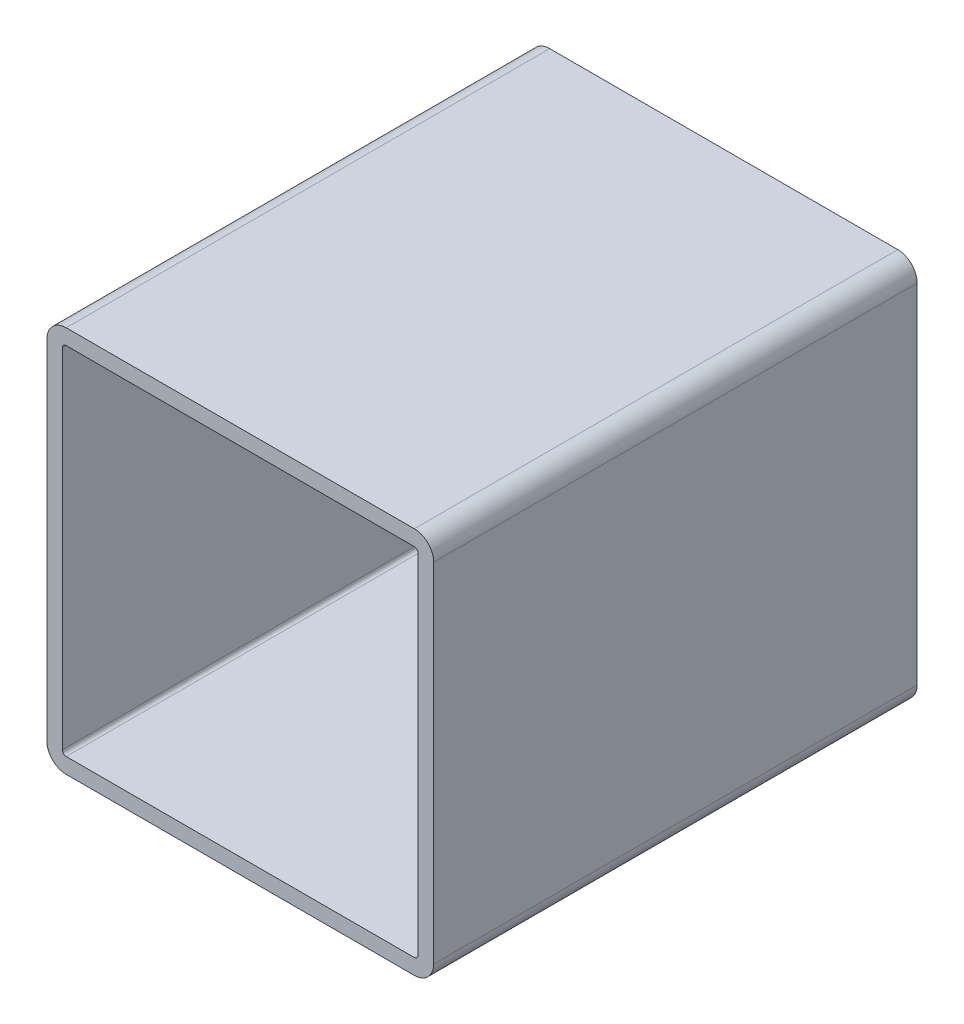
from build123d import *

# Parameters (mm, degrees)
BASE_EXTRUSION_DEPTH = 125


with BuildPart() as part:
    # Esquisse1 → Base-Extrusion (new body)
    with BuildSketch(Plane.XY):
        with BuildLine():
            Line((5, 0), (95, 0))
            ThreePointArc((95, 0), (98.535533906, -1.464466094), (100, -5))
            Line((100, -5), (100, -95))
            ThreePointArc((100, -95), (98.535533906, -98.535533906), (95, -100))
            Line((95, -100), (5, -100))
            ThreePointArc((5, -100), (1.464466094, -98.535533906), (0, -95))
            Line((0, -95), (0, -5))
            ThreePointArc((0, -5), (1.464466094, -1.464466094), (5, 0))
        make_face()
        with BuildLine():
            Line((5, -4), (95, -4))
            ThreePointArc((95, -4), (95.707106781, -4.292893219), (96, -5))
            Line((96, -5), (96, -95))
            ThreePointArc((96, -95), (95.707106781, -95.707106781), (95, -96))
            Line((95, -96), (5, -96))
            ThreePointArc((5, -96), (4.292893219, -95.707106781), (4, -95))
            Line((4, -95), (4, -5))
            ThreePointArc((4, -5), (4.292893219, -4.292893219), (5, -4))
        make_face(mode=Mode.SUBTRACT)
    extrude(amount=BASE_EXTRUSION_DEPTH)


solid = part.part
